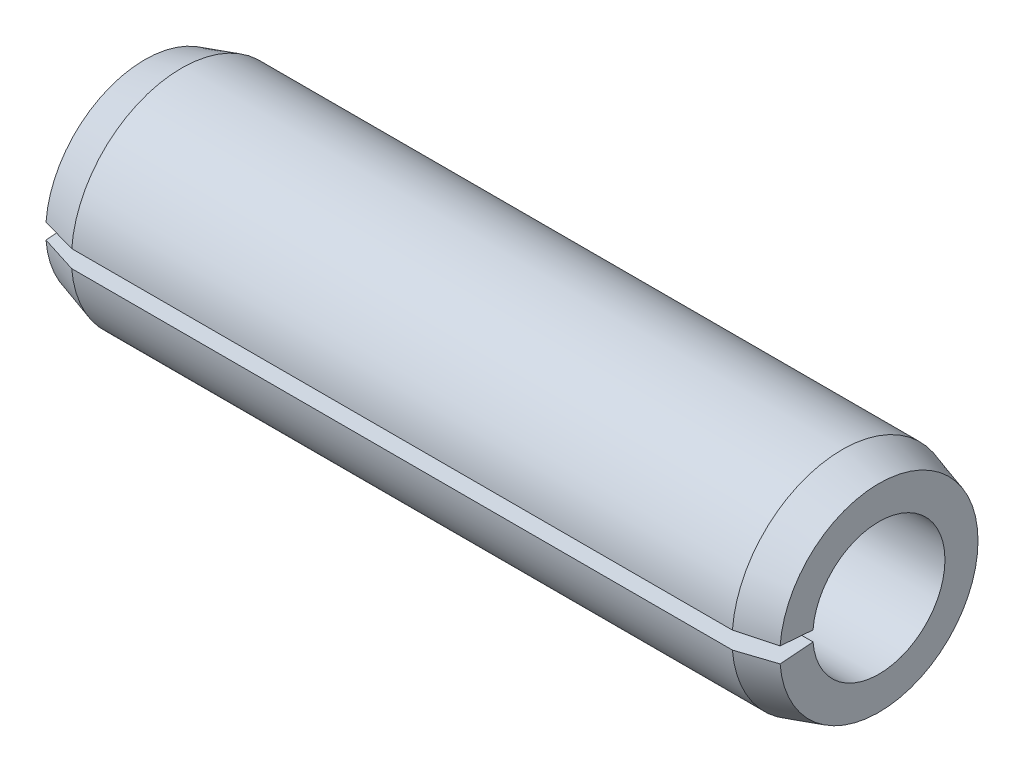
ISO-10303-21;
HEADER;
FILE_DESCRIPTION(('STEP AP214'),'2;1');
FILE_NAME('part.step','',(''),(''),'','','');
FILE_SCHEMA(('AUTOMOTIVE_DESIGN { 1 0 10303 214 1 1 1 1 }'));
ENDSEC;
DATA;
#1=APPLICATION_CONTEXT('core data for automotive mechanical design processes');
#2=APPLICATION_PROTOCOL_DEFINITION('international standard','automotive_design',2000,#1);
#3=PRODUCT_CONTEXT('',#1,'mechanical');
#4=PRODUCT('Part','Part','',(#3));
#5=PRODUCT_RELATED_PRODUCT_CATEGORY('part','',(#4));
#6=PRODUCT_DEFINITION_FORMATION('','',#4);
#7=PRODUCT_DEFINITION_CONTEXT('part definition',#1,'design');
#8=PRODUCT_DEFINITION('design','',#6,#7);
#9=PRODUCT_DEFINITION_SHAPE('','',#8);
#10=(LENGTH_UNIT() NAMED_UNIT(*) SI_UNIT(.MILLI.,.METRE.));
#11=(NAMED_UNIT(*) PLANE_ANGLE_UNIT() SI_UNIT($,.RADIAN.));
#12=(NAMED_UNIT(*) SI_UNIT($,.STERADIAN.) SOLID_ANGLE_UNIT());
#13=UNCERTAINTY_MEASURE_WITH_UNIT(LENGTH_MEASURE(1.E-05),#10,'distance_accuracy_value','');
#14=(GEOMETRIC_REPRESENTATION_CONTEXT(3) GLOBAL_UNCERTAINTY_ASSIGNED_CONTEXT((#13)) GLOBAL_UNIT_ASSIGNED_CONTEXT((#10,
#11,#12)) REPRESENTATION_CONTEXT('',''));
#15=CARTESIAN_POINT('',(0.,0.,0.));
#16=DIRECTION('',(0.,0.,1.));
#17=DIRECTION('',(1.,0.,0.));
#18=AXIS2_PLACEMENT_3D('',#15,#16,#17);
#19=CARTESIAN_POINT('',(0.,1.35,0.));
#20=DIRECTION('',(1.,0.,0.));
#21=DIRECTION('',(0.,0.,-1.));
#22=AXIS2_PLACEMENT_3D('',#19,#20,#21);
#23=PLANE('',#22);
#24=DIRECTION('',(0.,0.0784590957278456,0.996917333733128));
#25=VECTOR('',#24,1.);
#26=CARTESIAN_POINT('',(0.,0.,0.));
#27=LINE('',#26,#25);
#28=CARTESIAN_POINT('',(0.,0.0706131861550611,0.897225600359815));
#29=VERTEX_POINT('',#28);
#30=CARTESIAN_POINT('',(0.,0.105919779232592,1.34583840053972));
#31=VERTEX_POINT('',#30);
#32=EDGE_CURVE('E81',#29,#31,#27,.T.);
#33=ORIENTED_EDGE('',*,*,#32,.T.);
#34=CARTESIAN_POINT('',(0.,0.,0.));
#35=DIRECTION('',(-1.,0.,0.));
#36=DIRECTION('',(0.,0.,1.));
#37=AXIS2_PLACEMENT_3D('',#34,#35,#36);
#38=CIRCLE('',#37,1.35);
#39=CARTESIAN_POINT('',(0.,-0.105919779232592,1.34583840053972));
#40=VERTEX_POINT('',#39);
#41=EDGE_CURVE('E99',#31,#40,#38,.T.);
#42=ORIENTED_EDGE('',*,*,#41,.T.);
#43=DIRECTION('',(0.,-0.0784590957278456,0.996917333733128));
#44=VECTOR('',#43,1.);
#45=CARTESIAN_POINT('',(0.,0.,0.));
#46=LINE('',#45,#44);
#47=CARTESIAN_POINT('',(0.,-0.0706131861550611,0.897225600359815));
#48=VERTEX_POINT('',#47);
#49=EDGE_CURVE('E53',#48,#40,#46,.T.);
#50=ORIENTED_EDGE('',*,*,#49,.F.);
#51=CARTESIAN_POINT('',(0.,0.,0.));
#52=DIRECTION('',(-1.,0.,0.));
#53=DIRECTION('',(0.,0.,1.));
#54=AXIS2_PLACEMENT_3D('',#51,#52,#53);
#55=CIRCLE('',#54,0.9);
#56=EDGE_CURVE('E96',#29,#48,#55,.T.);
#57=ORIENTED_EDGE('',*,*,#56,.F.);
#58=EDGE_LOOP('',(#33,#42,#50,#57));
#59=FACE_BOUND('',#58,.T.);
#60=ADVANCED_FACE('F32',(#59),#23,.F.);
#61=CARTESIAN_POINT('',(-9.52499999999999,0.,0.));
#62=DIRECTION('',(-1.,0.,0.));
#63=DIRECTION('',(0.,0.,1.));
#64=AXIS2_PLACEMENT_3D('',#61,#62,#63);
#65=CYLINDRICAL_SURFACE('',#64,0.9);
#66=DIRECTION('',(-1.,0.,0.));
#67=VECTOR('',#66,1.);
#68=CARTESIAN_POINT('',(-9.52499999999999,0.070613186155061,0.897225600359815));
#69=LINE('',#68,#67);
#70=CARTESIAN_POINT('',(10.,0.0706131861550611,0.897225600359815));
#71=VERTEX_POINT('',#70);
#72=EDGE_CURVE('E84',#29,#71,#69,.F.);
#73=ORIENTED_EDGE('',*,*,#72,.F.);
#74=ORIENTED_EDGE('',*,*,#56,.T.);
#75=DIRECTION('',(-1.,0.,0.));
#76=VECTOR('',#75,1.);
#77=CARTESIAN_POINT('',(-9.52499999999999,-0.070613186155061,0.897225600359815));
#78=LINE('',#77,#76);
#79=CARTESIAN_POINT('',(10.,-0.0706131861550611,0.897225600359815));
#80=VERTEX_POINT('',#79);
#81=EDGE_CURVE('E117',#48,#80,#78,.F.);
#82=ORIENTED_EDGE('',*,*,#81,.T.);
#83=CARTESIAN_POINT('',(10.,0.,0.));
#84=DIRECTION('',(-1.,0.,0.));
#85=DIRECTION('',(0.,0.,1.));
#86=AXIS2_PLACEMENT_3D('',#83,#84,#85);
#87=CIRCLE('',#86,0.9);
#88=EDGE_CURVE('E98',#71,#80,#87,.T.);
#89=ORIENTED_EDGE('',*,*,#88,.F.);
#90=EDGE_LOOP('',(#73,#74,#82,#89));
#91=FACE_BOUND('',#90,.T.);
#92=ADVANCED_FACE('F94',(#91),#65,.F.);
#93=CARTESIAN_POINT('',(10.,0.9,0.));
#94=DIRECTION('',(-1.,0.,0.));
#95=DIRECTION('',(0.,0.,1.));
#96=AXIS2_PLACEMENT_3D('',#93,#94,#95);
#97=PLANE('',#96);
#98=DIRECTION('',(0.,0.0784590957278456,0.996917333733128));
#99=VECTOR('',#98,1.);
#100=CARTESIAN_POINT('',(10.,0.,0.));
#101=LINE('',#100,#99);
#102=CARTESIAN_POINT('',(10.,0.105919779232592,1.34583840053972));
#103=VERTEX_POINT('',#102);
#104=EDGE_CURVE('E126',#71,#103,#101,.T.);
#105=ORIENTED_EDGE('',*,*,#104,.F.);
#106=ORIENTED_EDGE('',*,*,#88,.T.);
#107=DIRECTION('',(0.,-0.0784590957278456,0.996917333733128));
#108=VECTOR('',#107,1.);
#109=CARTESIAN_POINT('',(10.,0.,0.));
#110=LINE('',#109,#108);
#111=CARTESIAN_POINT('',(10.,-0.105919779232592,1.34583840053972));
#112=VERTEX_POINT('',#111);
#113=EDGE_CURVE('E125',#80,#112,#110,.T.);
#114=ORIENTED_EDGE('',*,*,#113,.T.);
#115=CARTESIAN_POINT('',(10.,0.,0.));
#116=DIRECTION('',(-1.,0.,0.));
#117=DIRECTION('',(0.,0.,1.));
#118=AXIS2_PLACEMENT_3D('',#115,#116,#117);
#119=CIRCLE('',#118,1.35);
#120=EDGE_CURVE('E103',#103,#112,#119,.T.);
#121=ORIENTED_EDGE('',*,*,#120,.F.);
#122=EDGE_LOOP('',(#105,#106,#114,#121));
#123=FACE_BOUND('',#122,.T.);
#124=ADVANCED_FACE('F136',(#123),#97,.F.);
#125=CARTESIAN_POINT('',(10.,0.,0.));
#126=DIRECTION('',(-1.,0.,0.));
#127=DIRECTION('',(0.,0.,1.));
#128=AXIS2_PLACEMENT_3D('',#125,#126,#127);
#129=CONICAL_SURFACE('',#128,1.35,0.291456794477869);
#130=DIRECTION('',(-0.957826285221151,0.022545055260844,0.286462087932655));
#131=VECTOR('',#130,1.);
#132=CARTESIAN_POINT('',(14.5,0.,0.));
#133=LINE('',#132,#131);
#134=CARTESIAN_POINT('',(9.5,0.117688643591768,1.49537600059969));
#135=VERTEX_POINT('',#134);
#136=EDGE_CURVE('E100',#103,#135,#133,.T.);
#137=ORIENTED_EDGE('',*,*,#136,.F.);
#138=ORIENTED_EDGE('',*,*,#120,.T.);
#139=DIRECTION('',(-0.957826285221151,-0.022545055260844,0.286462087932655));
#140=VECTOR('',#139,1.);
#141=CARTESIAN_POINT('',(14.5,0.,0.));
#142=LINE('',#141,#140);
#143=CARTESIAN_POINT('',(9.5,-0.117688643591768,1.49537600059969));
#144=VERTEX_POINT('',#143);
#145=EDGE_CURVE('E119',#112,#144,#142,.T.);
#146=ORIENTED_EDGE('',*,*,#145,.T.);
#147=CARTESIAN_POINT('',(9.5,0.,0.));
#148=DIRECTION('',(-1.,0.,0.));
#149=DIRECTION('',(0.,0.,1.));
#150=AXIS2_PLACEMENT_3D('',#147,#148,#149);
#151=CIRCLE('',#150,1.5);
#152=EDGE_CURVE('E108',#135,#144,#151,.T.);
#153=ORIENTED_EDGE('',*,*,#152,.F.);
#154=EDGE_LOOP('',(#137,#138,#146,#153));
#155=FACE_BOUND('',#154,.T.);
#156=ADVANCED_FACE('F135',(#155),#129,.T.);
#157=CARTESIAN_POINT('',(-9.52499999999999,0.,0.));
#158=DIRECTION('',(-1.,0.,0.));
#159=DIRECTION('',(0.,0.,1.));
#160=AXIS2_PLACEMENT_3D('',#157,#158,#159);
#161=CYLINDRICAL_SURFACE('',#160,1.5);
#162=DIRECTION('',(-1.,0.,0.));
#163=VECTOR('',#162,1.);
#164=CARTESIAN_POINT('',(-9.52499999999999,0.117688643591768,1.49537600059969));
#165=LINE('',#164,#163);
#166=CARTESIAN_POINT('',(0.5,0.117688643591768,1.49537600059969));
#167=VERTEX_POINT('',#166);
#168=EDGE_CURVE('E45',#135,#167,#165,.T.);
#169=ORIENTED_EDGE('',*,*,#168,.F.);
#170=ORIENTED_EDGE('',*,*,#152,.T.);
#171=DIRECTION('',(-1.,0.,0.));
#172=VECTOR('',#171,1.);
#173=CARTESIAN_POINT('',(-9.52499999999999,-0.117688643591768,1.49537600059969));
#174=LINE('',#173,#172);
#175=CARTESIAN_POINT('',(0.5,-0.117688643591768,1.49537600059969));
#176=VERTEX_POINT('',#175);
#177=EDGE_CURVE('E122',#144,#176,#174,.T.);
#178=ORIENTED_EDGE('',*,*,#177,.T.);
#179=CARTESIAN_POINT('',(0.5,0.,0.));
#180=DIRECTION('',(-1.,0.,0.));
#181=DIRECTION('',(0.,0.,1.));
#182=AXIS2_PLACEMENT_3D('',#179,#180,#181);
#183=CIRCLE('',#182,1.5);
#184=EDGE_CURVE('E111',#167,#176,#183,.T.);
#185=ORIENTED_EDGE('',*,*,#184,.F.);
#186=EDGE_LOOP('',(#169,#170,#178,#185));
#187=FACE_BOUND('',#186,.T.);
#188=ADVANCED_FACE('F139',(#187),#161,.T.);
#189=CARTESIAN_POINT('',(0.5,0.,0.));
#190=DIRECTION('',(1.,0.,0.));
#191=DIRECTION('',(0.,0.,-1.));
#192=AXIS2_PLACEMENT_3D('',#189,#190,#191);
#193=CONICAL_SURFACE('',#192,1.5,0.291456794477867);
#194=DIRECTION('',(-0.957826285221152,-0.0225450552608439,-0.286462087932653));
#195=VECTOR('',#194,1.);
#196=CARTESIAN_POINT('',(-4.50000000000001,0.,0.));
#197=LINE('',#196,#195);
#198=EDGE_CURVE('E11',#167,#31,#197,.T.);
#199=ORIENTED_EDGE('',*,*,#198,.F.);
#200=ORIENTED_EDGE('',*,*,#184,.T.);
#201=DIRECTION('',(-0.957826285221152,0.0225450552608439,-0.286462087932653));
#202=VECTOR('',#201,1.);
#203=CARTESIAN_POINT('',(-4.50000000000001,0.,0.));
#204=LINE('',#203,#202);
#205=EDGE_CURVE('E39',#176,#40,#204,.T.);
#206=ORIENTED_EDGE('',*,*,#205,.T.);
#207=ORIENTED_EDGE('',*,*,#41,.F.);
#208=EDGE_LOOP('',(#199,#200,#206,#207));
#209=FACE_BOUND('',#208,.T.);
#210=ADVANCED_FACE('F142',(#209),#193,.T.);
#211=CARTESIAN_POINT('',(10.,0.,0.));
#212=DIRECTION('',(0.,-0.996917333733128,-0.0784590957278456));
#213=DIRECTION('',(0.,0.0784590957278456,-0.996917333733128));
#214=AXIS2_PLACEMENT_3D('',#211,#212,#213);
#215=PLANE('',#214);
#216=ORIENTED_EDGE('',*,*,#49,.T.);
#217=ORIENTED_EDGE('',*,*,#205,.F.);
#218=ORIENTED_EDGE('',*,*,#177,.F.);
#219=ORIENTED_EDGE('',*,*,#145,.F.);
#220=ORIENTED_EDGE('',*,*,#113,.F.);
#221=ORIENTED_EDGE('',*,*,#81,.F.);
#222=EDGE_LOOP('',(#216,#217,#218,#219,#220,#221));
#223=FACE_BOUND('',#222,.T.);
#224=ADVANCED_FACE('F137',(#223),#215,.F.);
#225=CARTESIAN_POINT('',(10.,0.,0.));
#226=DIRECTION('',(0.,-0.996917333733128,0.0784590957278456));
#227=DIRECTION('',(0.,-0.0784590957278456,-0.996917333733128));
#228=AXIS2_PLACEMENT_3D('',#225,#226,#227);
#229=PLANE('',#228);
#230=ORIENTED_EDGE('',*,*,#72,.T.);
#231=ORIENTED_EDGE('',*,*,#104,.T.);
#232=ORIENTED_EDGE('',*,*,#136,.T.);
#233=ORIENTED_EDGE('',*,*,#168,.T.);
#234=ORIENTED_EDGE('',*,*,#198,.T.);
#235=ORIENTED_EDGE('',*,*,#32,.F.);
#236=EDGE_LOOP('',(#230,#231,#232,#233,#234,#235));
#237=FACE_BOUND('',#236,.T.);
#238=ADVANCED_FACE('F83',(#237),#229,.T.);
#239=CLOSED_SHELL('',(#60,#92,#124,#156,#188,#210,#224,#238));
#240=MANIFOLD_SOLID_BREP('B2',#239);
#241=ADVANCED_BREP_SHAPE_REPRESENTATION('',(#18,#240),#14);
#242=SHAPE_DEFINITION_REPRESENTATION(#9,#241);
ENDSEC;
END-ISO-10303-21;
